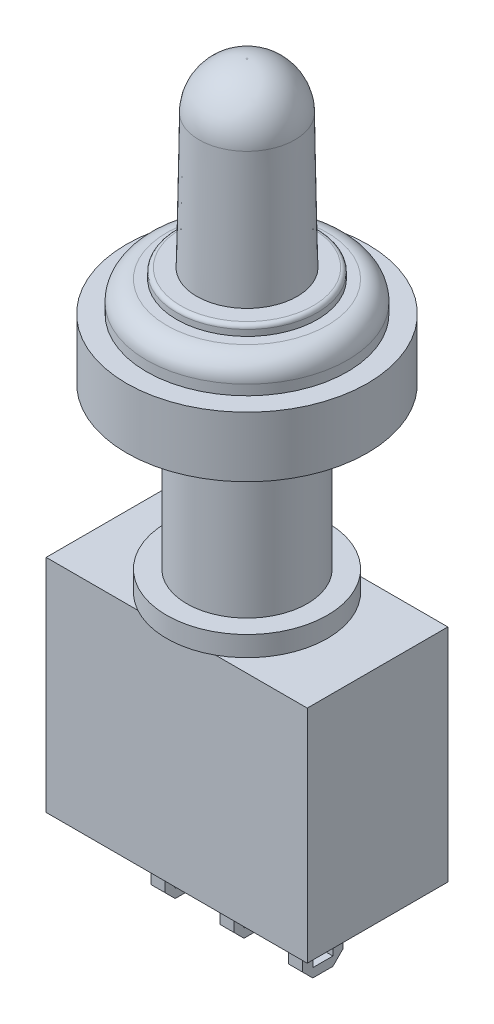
from build123d import *

# Parameters (mm, degrees)
ESQUISSE1_W             = 13
ESQUISSE1_H             = 11
BASE_EXTRUSION_DEPTH    = 7
ESQUISSE2_R             = 4
BOSS_EXTRU_1_DEPTH      = 1
ESQUISSE3_R             = 3
BOSS_EXTRU_2_DEPTH      = 8
ESQUISSE4_R             = 6
BOSS_EXTRU_4_DEPTH      = 3
ESQUISSE6_R             = 5
BOSS_EXTRU_5_DEPTH      = 1.5
CONG_2_R                = 1
ESQUISSE7_R             = 3.5
BOSS_EXTRU_6_DEPTH      = 0.5
CONG_3_R                = 0.2
ESQUISSE8_R             = 2.5
BOSS_EXTRU_7_DEPTH      = 9
BOSS_EXTRU_7_TAPER      = 1
CONG_4_R                = 2.35
ESQUISSE10_W            = 0.7
ESQUISSE10_H            = 2
BOSS_EXTRU_8_DEPTH      = 3.5
ESQUISSE11_W            = 1
ESQUISSE11_H            = 2.47840943
ENL_V_MAT_EXTRU_1_DEPTH = 46.219748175
CHANFREIN1_SIZE         = 0.5


with BuildPart() as part:
    # Esquisse1 → Base-Extrusion (new body)
    with BuildSketch(Plane.XY):
        with Locations((-33.5, 14.5)):
            Rectangle(ESQUISSE1_W, ESQUISSE1_H)
    extrude(amount=BASE_EXTRUSION_DEPTH)

    # Esquisse2 → Boss.-Extru.1 (add)
    with BuildSketch(Plane(origin=(0, 20, 0), x_dir=(-1, 0, 0), z_dir=(0, 1, 0))):
        with Locations(Location((33.5, 3.5, 0), (0, 0, 241.044975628))):
            Circle(ESQUISSE2_R)
    extrude(amount=BOSS_EXTRU_1_DEPTH)

    # Esquisse3 → Boss.-Extru.2 (add)
    with BuildSketch(Plane(origin=(0, 21, 0), x_dir=(-1, 0, 0), z_dir=(0, 1, 0))):
        with Locations(Location((33.5, 3.5, 0), (0, 0, 90))):
            Circle(ESQUISSE3_R)
    extrude(amount=BOSS_EXTRU_2_DEPTH)

    # Esquisse4 → Boss.-Extru.4 (add)
    with BuildSketch(Plane(origin=(0, 29, 0), x_dir=(-1, 0, 0), z_dir=(0, 1, 0))):
        with Locations(Location((33.5, 3.5, 0), (0, 0, 90))):
            Circle(ESQUISSE4_R)
    extrude(amount=BOSS_EXTRU_4_DEPTH)

    # Esquisse6 → Boss.-Extru.5 (add)
    with BuildSketch(Plane(origin=(0, 32, 0), x_dir=(-1, 0, 0), z_dir=(0, 1, 0))):
        with Locations(Location((33.5, 3.5, 0), (0, 0, 90))):
            Circle(ESQUISSE6_R)
    extrude(amount=BOSS_EXTRU_5_DEPTH)

    # Cong_2
    cong_2_edges = [part.edges().sort_by_distance(p)[0] for p in [
        (-33.5, 33.5, -1.5),
    ]]
    fillet(cong_2_edges, radius=CONG_2_R)

    # Esquisse7 → Boss.-Extru.6 (add)
    with BuildSketch(Plane(origin=(0, 33.5, 0), x_dir=(-1, 0, 0), z_dir=(0, 1, 0))):
        with Locations(Location((33.5, 3.5, 0), (0, 0, 90))):
            Circle(ESQUISSE7_R)
    extrude(amount=BOSS_EXTRU_6_DEPTH)

    # Cong_3
    cong_3_edges = [part.edges().sort_by_distance(p)[0] for p in [
        (-33.5, 34, 0),
    ]]
    fillet(cong_3_edges, radius=CONG_3_R)

    # Esquisse8 → Boss.-Extru.7 (add)
    with BuildSketch(Plane(origin=(0, 34, 0), x_dir=(-1, 0, 0), z_dir=(0, 1, 0))):
        with Locations((33.5, 3.5)):
            Circle(ESQUISSE8_R)
    extrude(amount=BOSS_EXTRU_7_DEPTH, taper=BOSS_EXTRU_7_TAPER)

    # Cong_4
    cong_4_edges = [part.edges().sort_by_distance(p)[0] for p in [
        (-31.157095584, 43, 3.5),
    ]]
    fillet(cong_4_edges, radius=CONG_4_R)

    # Esquisse10 → Boss.-Extru.8 (add)
    with BuildSketch(Plane.XZ.offset(-9)):
        with Locations((-36.925, 3.5)):
            Rectangle(ESQUISSE10_W, ESQUISSE10_H)
        with Locations((-33.5, 3.5)):
            Rectangle(ESQUISSE10_W, ESQUISSE10_H)
        with Locations((-30.075, 3.5)):
            Rectangle(ESQUISSE10_W, ESQUISSE10_H)
    extrude(amount=BOSS_EXTRU_8_DEPTH)

    # Esquisse11 → Enl_v. mat.-Extru.1 (cut, through all)
    with BuildSketch(Plane(origin=(-29.725, 0, 0), x_dir=(0, 0, -1), z_dir=(1, 0, 0))):
        with Locations((-3.5, 7.185934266)):
            Rectangle(ESQUISSE11_W, ESQUISSE11_H)
    extrude(amount=-ENL_V_MAT_EXTRU_1_DEPTH, mode=Mode.SUBTRACT)

    # Chanfrein1
    chanfrein1_edges = [part.edges().sort_by_distance(p)[0] for p in [
        (-30.075, 5.5, 2.5),
        (-30.075, 5.5, 4.5),
        (-33.5, 5.5, 2.5),
        (-33.5, 5.5, 4.5),
        (-36.925, 5.5, 2.5),
        (-36.925, 5.5, 4.5),
    ]]
    chamfer(chanfrein1_edges, length=CHANFREIN1_SIZE)


solid = part.part
